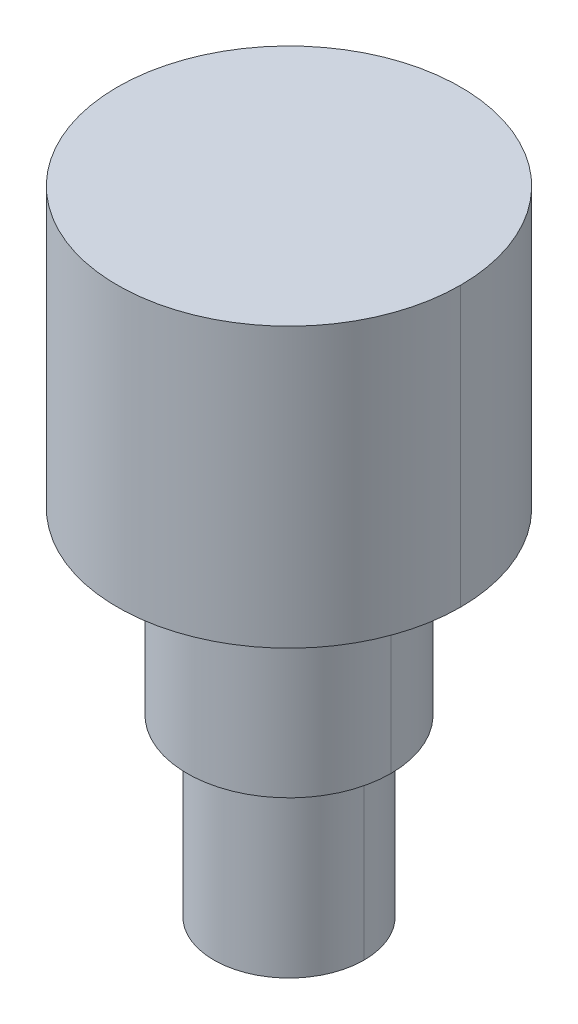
ISO-10303-21;
HEADER;
FILE_DESCRIPTION(('STEP AP214'),'2;1');
FILE_NAME('part.step','',(''),(''),'','','');
FILE_SCHEMA(('AUTOMOTIVE_DESIGN { 1 0 10303 214 1 1 1 1 }'));
ENDSEC;
DATA;
#1=APPLICATION_CONTEXT('core data for automotive mechanical design processes');
#2=APPLICATION_PROTOCOL_DEFINITION('international standard','automotive_design',2000,#1);
#3=PRODUCT_CONTEXT('',#1,'mechanical');
#4=PRODUCT('Part','Part','',(#3));
#5=PRODUCT_RELATED_PRODUCT_CATEGORY('part','',(#4));
#6=PRODUCT_DEFINITION_FORMATION('','',#4);
#7=PRODUCT_DEFINITION_CONTEXT('part definition',#1,'design');
#8=PRODUCT_DEFINITION('design','',#6,#7);
#9=PRODUCT_DEFINITION_SHAPE('','',#8);
#10=(LENGTH_UNIT() NAMED_UNIT(*) SI_UNIT(.MILLI.,.METRE.));
#11=(NAMED_UNIT(*) PLANE_ANGLE_UNIT() SI_UNIT($,.RADIAN.));
#12=(NAMED_UNIT(*) SI_UNIT($,.STERADIAN.) SOLID_ANGLE_UNIT());
#13=UNCERTAINTY_MEASURE_WITH_UNIT(LENGTH_MEASURE(1.E-05),#10,'distance_accuracy_value','');
#14=(GEOMETRIC_REPRESENTATION_CONTEXT(3) GLOBAL_UNCERTAINTY_ASSIGNED_CONTEXT((#13)) GLOBAL_UNIT_ASSIGNED_CONTEXT((#10,
#11,#12)) REPRESENTATION_CONTEXT('',''));
#15=CARTESIAN_POINT('',(0.,0.,0.));
#16=DIRECTION('',(0.,0.,1.));
#17=DIRECTION('',(1.,0.,0.));
#18=AXIS2_PLACEMENT_3D('',#15,#16,#17);
#19=CARTESIAN_POINT('',(0.,-46.83125,0.));
#20=DIRECTION('',(0.,-1.,0.));
#21=DIRECTION('',(0.,0.,-1.));
#22=AXIS2_PLACEMENT_3D('',#19,#20,#21);
#23=PLANE('',#22);
#24=CARTESIAN_POINT('',(0.,-46.83125,0.));
#25=DIRECTION('',(0.,-1.,0.));
#26=DIRECTION('',(0.,0.,-1.));
#27=AXIS2_PLACEMENT_3D('',#24,#25,#26);
#28=CIRCLE('',#27,11.1125);
#29=CARTESIAN_POINT('',(11.1125,-46.83125,0.));
#30=VERTEX_POINT('',#29);
#31=CARTESIAN_POINT('',(-11.1125,-46.83125,0.));
#32=VERTEX_POINT('',#31);
#33=EDGE_CURVE('E87',#30,#32,#28,.F.);
#34=ORIENTED_EDGE('',*,*,#33,.F.);
#35=CARTESIAN_POINT('',(0.,-46.83125,0.));
#36=DIRECTION('',(0.,-1.,0.));
#37=DIRECTION('',(0.,0.,-1.));
#38=AXIS2_PLACEMENT_3D('',#35,#36,#37);
#39=CIRCLE('',#38,11.1125);
#40=EDGE_CURVE('E19',#32,#30,#39,.F.);
#41=ORIENTED_EDGE('',*,*,#40,.F.);
#42=EDGE_LOOP('',(#34,#41));
#43=FACE_BOUND('',#42,.T.);
#44=ADVANCED_FACE('F16',(#43),#23,.T.);
#45=CARTESIAN_POINT('',(0.,-33.8772499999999,0.));
#46=DIRECTION('',(0.,-1.,0.));
#47=DIRECTION('',(0.,0.,-1.));
#48=AXIS2_PLACEMENT_3D('',#45,#46,#47);
#49=CYLINDRICAL_SURFACE('',#48,11.1125);
#50=DIRECTION('',(0.,-1.,0.));
#51=VECTOR('',#50,1.);
#52=CARTESIAN_POINT('',(-11.1125,-33.8772499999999,0.));
#53=LINE('',#52,#51);
#54=CARTESIAN_POINT('',(-11.1125,-20.9232500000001,0.));
#55=VERTEX_POINT('',#54);
#56=EDGE_CURVE('E85',#32,#55,#53,.F.);
#57=ORIENTED_EDGE('',*,*,#56,.F.);
#58=ORIENTED_EDGE('',*,*,#40,.T.);
#59=DIRECTION('',(0.,-1.,0.));
#60=VECTOR('',#59,1.);
#61=CARTESIAN_POINT('',(11.1125,-33.8772499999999,0.));
#62=LINE('',#61,#60);
#63=CARTESIAN_POINT('',(11.1125,-20.9232500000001,0.));
#64=VERTEX_POINT('',#63);
#65=EDGE_CURVE('E82',#64,#30,#62,.T.);
#66=ORIENTED_EDGE('',*,*,#65,.F.);
#67=CARTESIAN_POINT('',(0.,-20.9232500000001,0.));
#68=DIRECTION('',(0.,-1.,0.));
#69=DIRECTION('',(0.,0.,-1.));
#70=AXIS2_PLACEMENT_3D('',#67,#68,#69);
#71=CIRCLE('',#70,11.1125);
#72=EDGE_CURVE('E131',#55,#64,#71,.F.);
#73=ORIENTED_EDGE('',*,*,#72,.F.);
#74=EDGE_LOOP('',(#57,#58,#66,#73));
#75=FACE_BOUND('',#74,.T.);
#76=ADVANCED_FACE('F80',(#75),#49,.T.);
#77=CARTESIAN_POINT('',(0.,-33.8772499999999,0.));
#78=DIRECTION('',(0.,-1.,0.));
#79=DIRECTION('',(0.,0.,-1.));
#80=AXIS2_PLACEMENT_3D('',#77,#78,#79);
#81=CYLINDRICAL_SURFACE('',#80,11.1125);
#82=ORIENTED_EDGE('',*,*,#56,.T.);
#83=CARTESIAN_POINT('',(0.,-20.9232500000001,0.));
#84=DIRECTION('',(0.,-1.,0.));
#85=DIRECTION('',(0.,0.,-1.));
#86=AXIS2_PLACEMENT_3D('',#83,#84,#85);
#87=CIRCLE('',#86,11.1125);
#88=EDGE_CURVE('E91',#64,#55,#87,.F.);
#89=ORIENTED_EDGE('',*,*,#88,.F.);
#90=ORIENTED_EDGE('',*,*,#65,.T.);
#91=ORIENTED_EDGE('',*,*,#33,.T.);
#92=EDGE_LOOP('',(#82,#89,#90,#91));
#93=FACE_BOUND('',#92,.T.);
#94=ADVANCED_FACE('F89',(#93),#81,.T.);
#95=CARTESIAN_POINT('',(0.,-20.9232500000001,0.));
#96=DIRECTION('',(0.,-1.,0.));
#97=DIRECTION('',(0.,0.,-1.));
#98=AXIS2_PLACEMENT_3D('',#95,#96,#97);
#99=PLANE('',#98);
#100=ORIENTED_EDGE('',*,*,#72,.T.);
#101=ORIENTED_EDGE('',*,*,#88,.T.);
#102=EDGE_LOOP('',(#100,#101));
#103=FACE_BOUND('',#102,.T.);
#104=CARTESIAN_POINT('',(0.,-20.9232500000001,0.));
#105=DIRECTION('',(0.,-1.,0.));
#106=DIRECTION('',(0.,0.,-1.));
#107=AXIS2_PLACEMENT_3D('',#104,#105,#106);
#108=CIRCLE('',#107,15.08125);
#109=CARTESIAN_POINT('',(15.08125,-20.9232500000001,0.));
#110=VERTEX_POINT('',#109);
#111=CARTESIAN_POINT('',(-15.08125,-20.9232500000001,0.));
#112=VERTEX_POINT('',#111);
#113=EDGE_CURVE('E124',#110,#112,#108,.F.);
#114=ORIENTED_EDGE('',*,*,#113,.F.);
#115=CARTESIAN_POINT('',(0.,-20.9232500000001,0.));
#116=DIRECTION('',(0.,-1.,0.));
#117=DIRECTION('',(0.,0.,-1.));
#118=AXIS2_PLACEMENT_3D('',#115,#116,#117);
#119=CIRCLE('',#118,15.08125);
#120=EDGE_CURVE('E128',#112,#110,#119,.F.);
#121=ORIENTED_EDGE('',*,*,#120,.F.);
#122=EDGE_LOOP('',(#114,#121));
#123=FACE_BOUND('',#122,.T.);
#124=ADVANCED_FACE('F133',(#103,#123),#99,.T.);
#125=CARTESIAN_POINT('',(0.,-8.47724999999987,0.));
#126=DIRECTION('',(0.,-1.,0.));
#127=DIRECTION('',(0.,0.,-1.));
#128=AXIS2_PLACEMENT_3D('',#125,#126,#127);
#129=CYLINDRICAL_SURFACE('',#128,15.08125);
#130=DIRECTION('',(0.,-1.,0.));
#131=VECTOR('',#130,1.);
#132=CARTESIAN_POINT('',(-15.08125,-8.47724999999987,0.));
#133=LINE('',#132,#131);
#134=CARTESIAN_POINT('',(-15.08125,3.96875000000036,0.));
#135=VERTEX_POINT('',#134);
#136=EDGE_CURVE('E123',#112,#135,#133,.F.);
#137=ORIENTED_EDGE('',*,*,#136,.F.);
#138=ORIENTED_EDGE('',*,*,#120,.T.);
#139=DIRECTION('',(0.,-1.,0.));
#140=VECTOR('',#139,1.);
#141=CARTESIAN_POINT('',(15.08125,-8.47724999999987,0.));
#142=LINE('',#141,#140);
#143=CARTESIAN_POINT('',(15.08125,3.96875000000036,0.));
#144=VERTEX_POINT('',#143);
#145=EDGE_CURVE('E127',#144,#110,#142,.T.);
#146=ORIENTED_EDGE('',*,*,#145,.F.);
#147=CARTESIAN_POINT('',(0.,3.96875000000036,0.));
#148=DIRECTION('',(0.,-1.,0.));
#149=DIRECTION('',(0.,0.,-1.));
#150=AXIS2_PLACEMENT_3D('',#147,#148,#149);
#151=CIRCLE('',#150,15.08125);
#152=EDGE_CURVE('E120',#135,#144,#151,.F.);
#153=ORIENTED_EDGE('',*,*,#152,.F.);
#154=EDGE_LOOP('',(#137,#138,#146,#153));
#155=FACE_BOUND('',#154,.T.);
#156=ADVANCED_FACE('F136',(#155),#129,.T.);
#157=CARTESIAN_POINT('',(0.,-8.47724999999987,0.));
#158=DIRECTION('',(0.,-1.,0.));
#159=DIRECTION('',(0.,0.,-1.));
#160=AXIS2_PLACEMENT_3D('',#157,#158,#159);
#161=CYLINDRICAL_SURFACE('',#160,15.08125);
#162=ORIENTED_EDGE('',*,*,#136,.T.);
#163=CARTESIAN_POINT('',(0.,3.96875000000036,0.));
#164=DIRECTION('',(0.,-1.,0.));
#165=DIRECTION('',(0.,0.,-1.));
#166=AXIS2_PLACEMENT_3D('',#163,#164,#165);
#167=CIRCLE('',#166,15.08125);
#168=EDGE_CURVE('E117',#144,#135,#167,.F.);
#169=ORIENTED_EDGE('',*,*,#168,.F.);
#170=ORIENTED_EDGE('',*,*,#145,.T.);
#171=ORIENTED_EDGE('',*,*,#113,.T.);
#172=EDGE_LOOP('',(#162,#169,#170,#171));
#173=FACE_BOUND('',#172,.T.);
#174=ADVANCED_FACE('F144',(#173),#161,.T.);
#175=CARTESIAN_POINT('',(0.,3.96875,0.));
#176=DIRECTION('',(0.,-1.,0.));
#177=DIRECTION('',(0.,0.,-1.));
#178=AXIS2_PLACEMENT_3D('',#175,#176,#177);
#179=PLANE('',#178);
#180=ORIENTED_EDGE('',*,*,#152,.T.);
#181=ORIENTED_EDGE('',*,*,#168,.T.);
#182=EDGE_LOOP('',(#180,#181));
#183=FACE_BOUND('',#182,.T.);
#184=CARTESIAN_POINT('',(0.,3.96875,0.));
#185=DIRECTION('',(0.,-1.,0.));
#186=DIRECTION('',(0.,0.,-1.));
#187=AXIS2_PLACEMENT_3D('',#184,#185,#186);
#188=CIRCLE('',#187,19.05);
#189=CARTESIAN_POINT('',(19.05,3.96875,0.));
#190=VERTEX_POINT('',#189);
#191=CARTESIAN_POINT('',(-19.05,3.96875,0.));
#192=VERTEX_POINT('',#191);
#193=EDGE_CURVE('E111',#190,#192,#188,.F.);
#194=ORIENTED_EDGE('',*,*,#193,.F.);
#195=CARTESIAN_POINT('',(0.,3.96875,0.));
#196=DIRECTION('',(0.,-1.,0.));
#197=DIRECTION('',(0.,0.,-1.));
#198=AXIS2_PLACEMENT_3D('',#195,#196,#197);
#199=CIRCLE('',#198,19.05);
#200=EDGE_CURVE('E115',#192,#190,#199,.F.);
#201=ORIENTED_EDGE('',*,*,#200,.F.);
#202=EDGE_LOOP('',(#194,#201));
#203=FACE_BOUND('',#202,.T.);
#204=ADVANCED_FACE('F206',(#183,#203),#179,.T.);
#205=CARTESIAN_POINT('',(0.,4.7625,0.));
#206=DIRECTION('',(0.,-1.,0.));
#207=DIRECTION('',(0.,0.,-1.));
#208=AXIS2_PLACEMENT_3D('',#205,#206,#207);
#209=CYLINDRICAL_SURFACE('',#208,19.05);
#210=DIRECTION('',(0.,-1.,0.));
#211=VECTOR('',#210,1.);
#212=CARTESIAN_POINT('',(-19.05,4.7625,0.));
#213=LINE('',#212,#211);
#214=CARTESIAN_POINT('',(-19.05,5.55625,0.));
#215=VERTEX_POINT('',#214);
#216=EDGE_CURVE('E110',#192,#215,#213,.F.);
#217=ORIENTED_EDGE('',*,*,#216,.F.);
#218=ORIENTED_EDGE('',*,*,#200,.T.);
#219=DIRECTION('',(0.,-1.,0.));
#220=VECTOR('',#219,1.);
#221=CARTESIAN_POINT('',(19.05,4.7625,0.));
#222=LINE('',#221,#220);
#223=CARTESIAN_POINT('',(19.05,5.55625,0.));
#224=VERTEX_POINT('',#223);
#225=EDGE_CURVE('E114',#224,#190,#222,.T.);
#226=ORIENTED_EDGE('',*,*,#225,.F.);
#227=CARTESIAN_POINT('',(0.,5.55625,0.));
#228=DIRECTION('',(0.,-1.,0.));
#229=DIRECTION('',(0.,0.,-1.));
#230=AXIS2_PLACEMENT_3D('',#227,#228,#229);
#231=CIRCLE('',#230,19.05);
#232=EDGE_CURVE('E107',#215,#224,#231,.F.);
#233=ORIENTED_EDGE('',*,*,#232,.F.);
#234=EDGE_LOOP('',(#217,#218,#226,#233));
#235=FACE_BOUND('',#234,.T.);
#236=ADVANCED_FACE('F172',(#235),#209,.T.);
#237=CARTESIAN_POINT('',(0.,4.7625,0.));
#238=DIRECTION('',(0.,-1.,0.));
#239=DIRECTION('',(0.,0.,-1.));
#240=AXIS2_PLACEMENT_3D('',#237,#238,#239);
#241=CYLINDRICAL_SURFACE('',#240,19.05);
#242=ORIENTED_EDGE('',*,*,#216,.T.);
#243=CARTESIAN_POINT('',(0.,5.55625,0.));
#244=DIRECTION('',(0.,-1.,0.));
#245=DIRECTION('',(0.,0.,-1.));
#246=AXIS2_PLACEMENT_3D('',#243,#244,#245);
#247=CIRCLE('',#246,19.05);
#248=EDGE_CURVE('E104',#224,#215,#247,.F.);
#249=ORIENTED_EDGE('',*,*,#248,.F.);
#250=ORIENTED_EDGE('',*,*,#225,.T.);
#251=ORIENTED_EDGE('',*,*,#193,.T.);
#252=EDGE_LOOP('',(#242,#249,#250,#251));
#253=FACE_BOUND('',#252,.T.);
#254=ADVANCED_FACE('F162',(#253),#241,.T.);
#255=CARTESIAN_POINT('',(0.,5.55625,0.));
#256=DIRECTION('',(0.,-1.,0.));
#257=DIRECTION('',(0.,0.,-1.));
#258=AXIS2_PLACEMENT_3D('',#255,#256,#257);
#259=PLANE('',#258);
#260=ORIENTED_EDGE('',*,*,#232,.T.);
#261=ORIENTED_EDGE('',*,*,#248,.T.);
#262=EDGE_LOOP('',(#260,#261));
#263=FACE_BOUND('',#262,.T.);
#264=CARTESIAN_POINT('',(0.,5.55625,0.));
#265=DIRECTION('',(0.,-1.,0.));
#266=DIRECTION('',(0.,0.,-1.));
#267=AXIS2_PLACEMENT_3D('',#264,#265,#266);
#268=CIRCLE('',#267,25.4);
#269=CARTESIAN_POINT('',(25.4,5.55625,0.));
#270=VERTEX_POINT('',#269);
#271=CARTESIAN_POINT('',(-25.4,5.55625,0.));
#272=VERTEX_POINT('',#271);
#273=EDGE_CURVE('E97',#270,#272,#268,.F.);
#274=ORIENTED_EDGE('',*,*,#273,.F.);
#275=CARTESIAN_POINT('',(0.,5.55625,0.));
#276=DIRECTION('',(0.,-1.,0.));
#277=DIRECTION('',(0.,0.,-1.));
#278=AXIS2_PLACEMENT_3D('',#275,#276,#277);
#279=CIRCLE('',#278,25.4);
#280=EDGE_CURVE('E102',#272,#270,#279,.F.);
#281=ORIENTED_EDGE('',*,*,#280,.F.);
#282=EDGE_LOOP('',(#274,#281));
#283=FACE_BOUND('',#282,.T.);
#284=ADVANCED_FACE('F160',(#263,#283),#259,.T.);
#285=CARTESIAN_POINT('',(0.,26.9875,0.));
#286=DIRECTION('',(0.,-1.,0.));
#287=DIRECTION('',(0.,0.,-1.));
#288=AXIS2_PLACEMENT_3D('',#285,#286,#287);
#289=CYLINDRICAL_SURFACE('',#288,25.4);
#290=DIRECTION('',(0.,-1.,0.));
#291=VECTOR('',#290,1.);
#292=CARTESIAN_POINT('',(-25.4,26.9875,0.));
#293=LINE('',#292,#291);
#294=CARTESIAN_POINT('',(-25.4,46.83125,0.));
#295=VERTEX_POINT('',#294);
#296=EDGE_CURVE('E25',#272,#295,#293,.F.);
#297=ORIENTED_EDGE('',*,*,#296,.F.);
#298=ORIENTED_EDGE('',*,*,#280,.T.);
#299=DIRECTION('',(0.,-1.,0.));
#300=VECTOR('',#299,1.);
#301=CARTESIAN_POINT('',(25.4,26.9875,0.));
#302=LINE('',#301,#300);
#303=CARTESIAN_POINT('',(25.4,46.83125,0.));
#304=VERTEX_POINT('',#303);
#305=EDGE_CURVE('E100',#304,#270,#302,.T.);
#306=ORIENTED_EDGE('',*,*,#305,.F.);
#307=CARTESIAN_POINT('',(0.,46.83125,0.));
#308=DIRECTION('',(0.,-1.,0.));
#309=DIRECTION('',(0.,0.,-1.));
#310=AXIS2_PLACEMENT_3D('',#307,#308,#309);
#311=CIRCLE('',#310,25.4);
#312=EDGE_CURVE('E34',#304,#295,#311,.T.);
#313=ORIENTED_EDGE('',*,*,#312,.T.);
#314=EDGE_LOOP('',(#297,#298,#306,#313));
#315=FACE_BOUND('',#314,.T.);
#316=ADVANCED_FACE('F158',(#315),#289,.T.);
#317=CARTESIAN_POINT('',(0.,46.83125,0.));
#318=DIRECTION('',(0.,-1.,0.));
#319=DIRECTION('',(0.,0.,-1.));
#320=AXIS2_PLACEMENT_3D('',#317,#318,#319);
#321=PLANE('',#320);
#322=CARTESIAN_POINT('',(0.,46.83125,0.));
#323=DIRECTION('',(0.,-1.,0.));
#324=DIRECTION('',(0.,0.,-1.));
#325=AXIS2_PLACEMENT_3D('',#322,#323,#324);
#326=CIRCLE('',#325,25.4);
#327=EDGE_CURVE('E11',#295,#304,#326,.T.);
#328=ORIENTED_EDGE('',*,*,#327,.F.);
#329=ORIENTED_EDGE('',*,*,#312,.F.);
#330=EDGE_LOOP('',(#328,#329));
#331=FACE_BOUND('',#330,.T.);
#332=ADVANCED_FACE('F170',(#331),#321,.F.);
#333=CARTESIAN_POINT('',(0.,26.9875,0.));
#334=DIRECTION('',(0.,-1.,0.));
#335=DIRECTION('',(0.,0.,-1.));
#336=AXIS2_PLACEMENT_3D('',#333,#334,#335);
#337=CYLINDRICAL_SURFACE('',#336,25.4);
#338=ORIENTED_EDGE('',*,*,#296,.T.);
#339=ORIENTED_EDGE('',*,*,#327,.T.);
#340=ORIENTED_EDGE('',*,*,#305,.T.);
#341=ORIENTED_EDGE('',*,*,#273,.T.);
#342=EDGE_LOOP('',(#338,#339,#340,#341));
#343=FACE_BOUND('',#342,.T.);
#344=ADVANCED_FACE('F156',(#343),#337,.T.);
#345=CLOSED_SHELL('',(#44,#76,#94,#124,#156,#174,#204,#236,#254,#284,#316,#332,#344));
#346=MANIFOLD_SOLID_BREP('B1',#345);
#347=ADVANCED_BREP_SHAPE_REPRESENTATION('',(#18,#346),#14);
#348=SHAPE_DEFINITION_REPRESENTATION(#9,#347);
ENDSEC;
END-ISO-10303-21;
